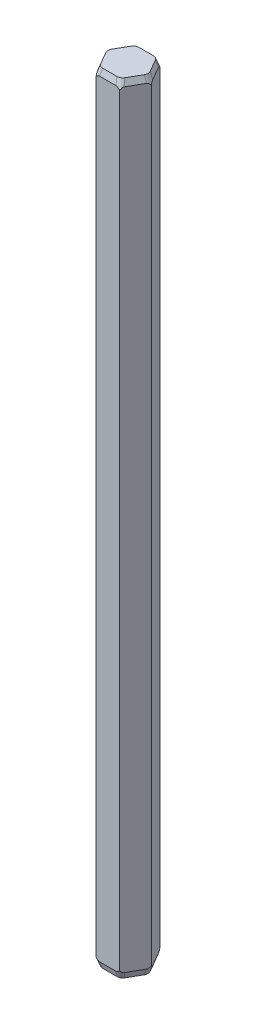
from build123d import *
from OCP.BRepFilletAPI import BRepFilletAPI_MakeChamfer

# Parameters (mm, degrees)
BOSS_EXTRUDE1_DEPTH = 50
CHAMFER1_SIZE       = 0.4
CHAMFER1_SIZE2      = 0.137731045
FILLET1_R           = 0.4


with BuildPart() as part:
    # Sketch1 → Boss-Extrude1 (new body)
    with BuildSketch(Plane(origin=(0, 0, 0), x_dir=(1, 0, 0), z_dir=(0, 1, 0))):
        Polygon((1.5, 0), (0.75, 1.299038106), (-0.75, 1.299038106), (-1.5, 0), (-0.75, -1.299038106), (0.75, -1.299038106), align=None)
    extrude(amount=BOSS_EXTRUDE1_DEPTH)

    # Chamfer1: one chamfer whose edges measure the first distance from different faces: ONE call of the kernel's chamfer builder (chamfer() names one face for all edges)
    chamfer1_edges_1 = [part.edges().sort_by_distance(p)[0] for p in [
        (0, 50, -1.299038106),
        (0, 0, -1.299038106),
    ]]
    chamfer1_side_1 = [part.faces().sort_by_distance(p)[0] for p in [
        (0, 25, -1.299038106),
    ]]
    chamfer1_edges_2 = [part.edges().sort_by_distance(p)[0] for p in [
        (-1.125, 50, -0.649519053),
        (-1.125, 0, -0.649519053),
    ]]
    chamfer1_side_2 = [part.faces().sort_by_distance(p)[0] for p in [
        (-1.125, 25, -0.649519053),
    ]]
    chamfer1_edges_3 = [part.edges().sort_by_distance(p)[0] for p in [
        (-1.125, 50, 0.649519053),
        (-1.125, 0, 0.649519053),
    ]]
    chamfer1_side_3 = [part.faces().sort_by_distance(p)[0] for p in [
        (-1.125, 25, 0.649519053),
    ]]
    chamfer1_edges_4 = [part.edges().sort_by_distance(p)[0] for p in [
        (0, 50, 1.299038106),
        (0, 0, 1.299038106),
    ]]
    chamfer1_side_4 = [part.faces().sort_by_distance(p)[0] for p in [
        (0, 25, 1.299038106),
    ]]
    chamfer1_edges_5 = [part.edges().sort_by_distance(p)[0] for p in [
        (1.125, 50, 0.649519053),
        (1.125, 0, 0.649519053),
    ]]
    chamfer1_side_5 = [part.faces().sort_by_distance(p)[0] for p in [
        (1.125, 25, 0.649519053),
    ]]
    chamfer1_edges_6 = [part.edges().sort_by_distance(p)[0] for p in [
        (1.125, 50, -0.649519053),
        (1.125, 0, -0.649519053),
    ]]
    chamfer1_side_6 = [part.faces().sort_by_distance(p)[0] for p in [
        (1.125, 25, -0.649519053),
    ]]
    chamfer1 = BRepFilletAPI_MakeChamfer(part.part.solid().wrapped)
    for e in chamfer1_edges_1:
        chamfer1.Add(CHAMFER1_SIZE, CHAMFER1_SIZE2, e.wrapped, chamfer1_side_1[0].wrapped)  # the first distance lies on this face
    for e in chamfer1_edges_2:
        chamfer1.Add(CHAMFER1_SIZE, CHAMFER1_SIZE2, e.wrapped, chamfer1_side_2[0].wrapped)  # the first distance lies on this face
    for e in chamfer1_edges_3:
        chamfer1.Add(CHAMFER1_SIZE, CHAMFER1_SIZE2, e.wrapped, chamfer1_side_3[0].wrapped)  # the first distance lies on this face
    for e in chamfer1_edges_4:
        chamfer1.Add(CHAMFER1_SIZE, CHAMFER1_SIZE2, e.wrapped, chamfer1_side_4[0].wrapped)  # the first distance lies on this face
    for e in chamfer1_edges_5:
        chamfer1.Add(CHAMFER1_SIZE, CHAMFER1_SIZE2, e.wrapped, chamfer1_side_5[0].wrapped)  # the first distance lies on this face
    for e in chamfer1_edges_6:
        chamfer1.Add(CHAMFER1_SIZE, CHAMFER1_SIZE2, e.wrapped, chamfer1_side_6[0].wrapped)  # the first distance lies on this face
    add(Compound.cast(chamfer1.Shape()), mode=Mode.REPLACE)

    # Fillet1
    fillet1_edges = [part.edges().sort_by_distance(p)[0] for p in [
        (-0.710240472, 0.2, 1.230172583),
        (-1.420480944, 0.2, 0),
        (0.710240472, 0.2, 1.230172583),
        (-0.710240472, 0.2, -1.230172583),
        (1.420480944, 0.2, 0),
        (0.710240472, 0.2, -1.230172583),
        (-0.710240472, 49.8, -1.230172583),
        (0.710240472, 49.8, -1.230172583),
        (-1.420480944, 49.8, 0),
        (1.420480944, 49.8, 0),
        (-0.710240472, 49.8, 1.230172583),
        (0.710240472, 49.8, 1.230172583),
    ]]
    fillet(fillet1_edges, radius=FILLET1_R)


solid = part.part
